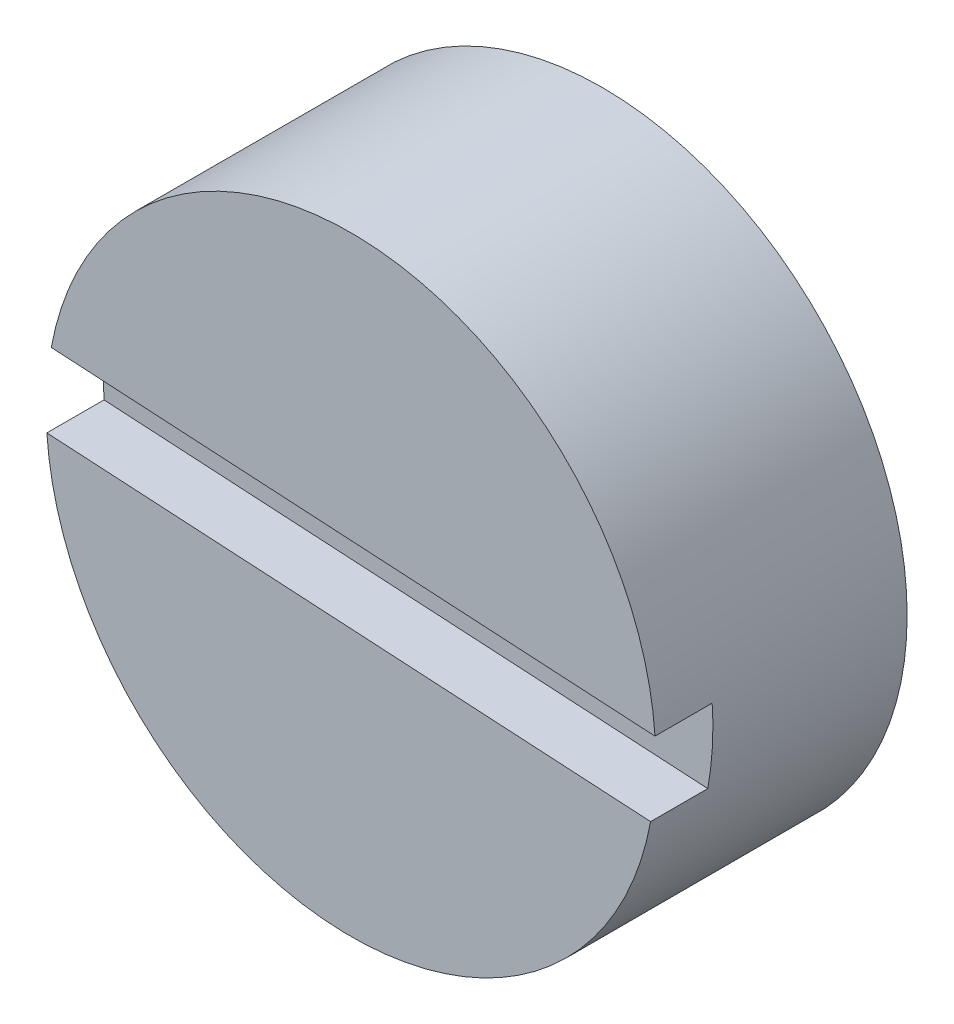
ISO-10303-21;
HEADER;
FILE_DESCRIPTION(('STEP AP214'),'2;1');
FILE_NAME('part.step','',(''),(''),'','','');
FILE_SCHEMA(('AUTOMOTIVE_DESIGN { 1 0 10303 214 1 1 1 1 }'));
ENDSEC;
DATA;
#1=APPLICATION_CONTEXT('core data for automotive mechanical design processes');
#2=APPLICATION_PROTOCOL_DEFINITION('international standard','automotive_design',2000,#1);
#3=PRODUCT_CONTEXT('',#1,'mechanical');
#4=PRODUCT('Part','Part','',(#3));
#5=PRODUCT_RELATED_PRODUCT_CATEGORY('part','',(#4));
#6=PRODUCT_DEFINITION_FORMATION('','',#4);
#7=PRODUCT_DEFINITION_CONTEXT('part definition',#1,'design');
#8=PRODUCT_DEFINITION('design','',#6,#7);
#9=PRODUCT_DEFINITION_SHAPE('','',#8);
#10=(LENGTH_UNIT() NAMED_UNIT(*) SI_UNIT(.MILLI.,.METRE.));
#11=(NAMED_UNIT(*) PLANE_ANGLE_UNIT() SI_UNIT($,.RADIAN.));
#12=(NAMED_UNIT(*) SI_UNIT($,.STERADIAN.) SOLID_ANGLE_UNIT());
#13=UNCERTAINTY_MEASURE_WITH_UNIT(LENGTH_MEASURE(1.E-05),#10,'distance_accuracy_value','');
#14=(GEOMETRIC_REPRESENTATION_CONTEXT(3) GLOBAL_UNCERTAINTY_ASSIGNED_CONTEXT((#13)) GLOBAL_UNIT_ASSIGNED_CONTEXT((#10,
#11,#12)) REPRESENTATION_CONTEXT('',''));
#15=CARTESIAN_POINT('',(0.,0.,0.));
#16=DIRECTION('',(0.,0.,1.));
#17=DIRECTION('',(1.,0.,0.));
#18=AXIS2_PLACEMENT_3D('',#15,#16,#17);
#19=CARTESIAN_POINT('',(0.,0.,3.3));
#20=DIRECTION('',(0.,0.,-1.));
#21=DIRECTION('',(-1.,0.,0.));
#22=AXIS2_PLACEMENT_3D('',#19,#20,#21);
#23=PLANE('',#22);
#24=CARTESIAN_POINT('',(0.,0.,3.3));
#25=DIRECTION('',(0.,0.,1.));
#26=DIRECTION('',(1.,0.,0.));
#27=AXIS2_PLACEMENT_3D('',#24,#25,#26);
#28=CIRCLE('',#27,4.);
#29=CARTESIAN_POINT('',(3.93332808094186,-0.727275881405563,3.3));
#30=VERTEX_POINT('',#29);
#31=CARTESIAN_POINT('',(-3.99080449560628,-0.271070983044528,3.3));
#32=VERTEX_POINT('',#31);
#33=EDGE_CURVE('E19',#30,#32,#28,.F.);
#34=ORIENTED_EDGE('',*,*,#33,.F.);
#35=DIRECTION('',(0.998346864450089,-0.057476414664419,0.));
#36=VECTOR('',#35,1.);
#37=CARTESIAN_POINT('',(-3.99080449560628,-0.271070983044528,3.3));
#38=LINE('',#37,#36);
#39=EDGE_CURVE('E54',#30,#32,#38,.F.);
#40=ORIENTED_EDGE('',*,*,#39,.T.);
#41=EDGE_LOOP('',(#34,#40));
#42=FACE_BOUND('',#41,.T.);
#43=ADVANCED_FACE('F16',(#42),#23,.F.);
#44=CARTESIAN_POINT('',(-3.99080449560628,-0.271070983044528,3.3));
#45=DIRECTION('',(-0.057476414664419,-0.998346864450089,0.));
#46=DIRECTION('',(0.998346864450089,-0.057476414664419,0.));
#47=AXIS2_PLACEMENT_3D('',#44,#45,#46);
#48=PLANE('',#47);
#49=DIRECTION('',(0.,0.,1.));
#50=VECTOR('',#49,1.);
#51=CARTESIAN_POINT('',(-3.99080449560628,-0.271070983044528,0.));
#52=LINE('',#51,#50);
#53=CARTESIAN_POINT('',(-3.99080449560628,-0.271070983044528,2.55));
#54=VERTEX_POINT('',#53);
#55=EDGE_CURVE('E62',#32,#54,#52,.F.);
#56=ORIENTED_EDGE('',*,*,#55,.F.);
#57=ORIENTED_EDGE('',*,*,#39,.F.);
#58=DIRECTION('',(0.,0.,1.));
#59=VECTOR('',#58,1.);
#60=CARTESIAN_POINT('',(3.93332808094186,-0.727275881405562,0.));
#61=LINE('',#60,#59);
#62=CARTESIAN_POINT('',(3.93332808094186,-0.727275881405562,2.55));
#63=VERTEX_POINT('',#62);
#64=EDGE_CURVE('E74',#63,#30,#61,.T.);
#65=ORIENTED_EDGE('',*,*,#64,.F.);
#66=DIRECTION('',(0.998346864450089,-0.0574764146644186,0.));
#67=VECTOR('',#66,1.);
#68=CARTESIAN_POINT('',(-3.99080449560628,-0.271070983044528,2.55));
#69=LINE('',#68,#67);
#70=EDGE_CURVE('E65',#54,#63,#69,.T.);
#71=ORIENTED_EDGE('',*,*,#70,.F.);
#72=EDGE_LOOP('',(#56,#57,#65,#71));
#73=FACE_BOUND('',#72,.T.);
#74=ADVANCED_FACE('F63',(#73),#48,.F.);
#75=CARTESIAN_POINT('',(0.,0.,3.3));
#76=DIRECTION('',(0.,0.,-1.));
#77=DIRECTION('',(-1.,0.,0.));
#78=AXIS2_PLACEMENT_3D('',#75,#76,#77);
#79=PLANE('',#78);
#80=CARTESIAN_POINT('',(0.,0.,3.3));
#81=DIRECTION('',(0.,0.,1.));
#82=DIRECTION('',(1.,0.,0.));
#83=AXIS2_PLACEMENT_3D('',#80,#81,#82);
#84=CIRCLE('',#83,4.);
#85=CARTESIAN_POINT('',(-3.93302205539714,0.728929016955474,3.3));
#86=VERTEX_POINT('',#85);
#87=CARTESIAN_POINT('',(3.9906902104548,0.2727483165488,3.3));
#88=VERTEX_POINT('',#87);
#89=EDGE_CURVE('E84',#86,#88,#84,.F.);
#90=ORIENTED_EDGE('',*,*,#89,.F.);
#91=DIRECTION('',(-0.998346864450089,0.057476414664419,0.));
#92=VECTOR('',#91,1.);
#93=CARTESIAN_POINT('',(3.9906902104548,0.2727483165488,3.3));
#94=LINE('',#93,#92);
#95=EDGE_CURVE('E59',#86,#88,#94,.F.);
#96=ORIENTED_EDGE('',*,*,#95,.T.);
#97=EDGE_LOOP('',(#90,#96));
#98=FACE_BOUND('',#97,.T.);
#99=ADVANCED_FACE('F93',(#98),#79,.F.);
#100=CARTESIAN_POINT('',(3.9906902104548,0.2727483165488,3.3));
#101=DIRECTION('',(0.057476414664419,0.998346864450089,0.));
#102=DIRECTION('',(-0.998346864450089,0.057476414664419,0.));
#103=AXIS2_PLACEMENT_3D('',#100,#101,#102);
#104=PLANE('',#103);
#105=DIRECTION('',(0.,0.,1.));
#106=VECTOR('',#105,1.);
#107=CARTESIAN_POINT('',(3.9906902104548,0.2727483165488,0.));
#108=LINE('',#107,#106);
#109=CARTESIAN_POINT('',(3.9906902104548,0.2727483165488,2.55));
#110=VERTEX_POINT('',#109);
#111=EDGE_CURVE('E79',#88,#110,#108,.F.);
#112=ORIENTED_EDGE('',*,*,#111,.F.);
#113=ORIENTED_EDGE('',*,*,#95,.F.);
#114=DIRECTION('',(0.,0.,1.));
#115=VECTOR('',#114,1.);
#116=CARTESIAN_POINT('',(-3.93302205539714,0.728929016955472,0.));
#117=LINE('',#116,#115);
#118=CARTESIAN_POINT('',(-3.93302205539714,0.728929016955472,2.55));
#119=VERTEX_POINT('',#118);
#120=EDGE_CURVE('E82',#119,#86,#117,.T.);
#121=ORIENTED_EDGE('',*,*,#120,.F.);
#122=DIRECTION('',(-0.998346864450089,0.0574764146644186,0.));
#123=VECTOR('',#122,1.);
#124=CARTESIAN_POINT('',(3.9906902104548,0.2727483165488,2.55));
#125=LINE('',#124,#123);
#126=EDGE_CURVE('E34',#110,#119,#125,.T.);
#127=ORIENTED_EDGE('',*,*,#126,.F.);
#128=EDGE_LOOP('',(#112,#113,#121,#127));
#129=FACE_BOUND('',#128,.T.);
#130=ADVANCED_FACE('F90',(#129),#104,.F.);
#131=CARTESIAN_POINT('',(4.7283012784E-05,0.000821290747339,2.55));
#132=DIRECTION('',(0.,0.,1.));
#133=DIRECTION('',(1.,0.,0.));
#134=AXIS2_PLACEMENT_3D('',#131,#132,#133);
#135=PLANE('',#134);
#136=CARTESIAN_POINT('',(0.,0.,2.55));
#137=DIRECTION('',(0.,0.,1.));
#138=DIRECTION('',(1.,0.,0.));
#139=AXIS2_PLACEMENT_3D('',#136,#137,#138);
#140=CIRCLE('',#139,4.);
#141=EDGE_CURVE('E69',#54,#119,#140,.F.);
#142=ORIENTED_EDGE('',*,*,#141,.F.);
#143=ORIENTED_EDGE('',*,*,#70,.T.);
#144=CARTESIAN_POINT('',(0.,0.,2.55));
#145=DIRECTION('',(0.,0.,1.));
#146=DIRECTION('',(1.,0.,0.));
#147=AXIS2_PLACEMENT_3D('',#144,#145,#146);
#148=CIRCLE('',#147,4.);
#149=EDGE_CURVE('E25',#110,#63,#148,.F.);
#150=ORIENTED_EDGE('',*,*,#149,.F.);
#151=ORIENTED_EDGE('',*,*,#126,.T.);
#152=EDGE_LOOP('',(#142,#143,#150,#151));
#153=FACE_BOUND('',#152,.T.);
#154=ADVANCED_FACE('F89',(#153),#135,.T.);
#155=CARTESIAN_POINT('',(0.,0.,0.));
#156=DIRECTION('',(0.,0.,-1.));
#157=DIRECTION('',(-1.,0.,0.));
#158=AXIS2_PLACEMENT_3D('',#155,#156,#157);
#159=PLANE('',#158);
#160=CARTESIAN_POINT('',(0.,0.,0.));
#161=DIRECTION('',(0.,0.,1.));
#162=DIRECTION('',(1.,0.,0.));
#163=AXIS2_PLACEMENT_3D('',#160,#161,#162);
#164=CIRCLE('',#163,4.);
#165=CARTESIAN_POINT('',(4.,0.,0.));
#166=VERTEX_POINT('',#165);
#167=EDGE_CURVE('E11',#166,#166,#164,.T.);
#168=ORIENTED_EDGE('',*,*,#167,.F.);
#169=EDGE_LOOP('',(#168));
#170=FACE_BOUND('',#169,.T.);
#171=ADVANCED_FACE('F104',(#170),#159,.T.);
#172=CARTESIAN_POINT('',(0.,0.,0.));
#173=DIRECTION('',(0.,0.,1.));
#174=DIRECTION('',(1.,0.,0.));
#175=AXIS2_PLACEMENT_3D('',#172,#173,#174);
#176=CYLINDRICAL_SURFACE('',#175,4.);
#177=ORIENTED_EDGE('',*,*,#167,.T.);
#178=EDGE_LOOP('',(#177));
#179=FACE_BOUND('',#178,.T.);
#180=ORIENTED_EDGE('',*,*,#111,.T.);
#181=ORIENTED_EDGE('',*,*,#149,.T.);
#182=ORIENTED_EDGE('',*,*,#64,.T.);
#183=ORIENTED_EDGE('',*,*,#33,.T.);
#184=ORIENTED_EDGE('',*,*,#55,.T.);
#185=ORIENTED_EDGE('',*,*,#141,.T.);
#186=ORIENTED_EDGE('',*,*,#120,.T.);
#187=ORIENTED_EDGE('',*,*,#89,.T.);
#188=EDGE_LOOP('',(#180,#181,#182,#183,#184,#185,#186,#187));
#189=FACE_BOUND('',#188,.T.);
#190=ADVANCED_FACE('F72',(#179,#189),#176,.T.);
#191=CLOSED_SHELL('',(#43,#74,#99,#130,#154,#171,#190));
#192=MANIFOLD_SOLID_BREP('B1',#191);
#193=ADVANCED_BREP_SHAPE_REPRESENTATION('',(#18,#192),#14);
#194=SHAPE_DEFINITION_REPRESENTATION(#9,#193);
ENDSEC;
END-ISO-10303-21;
